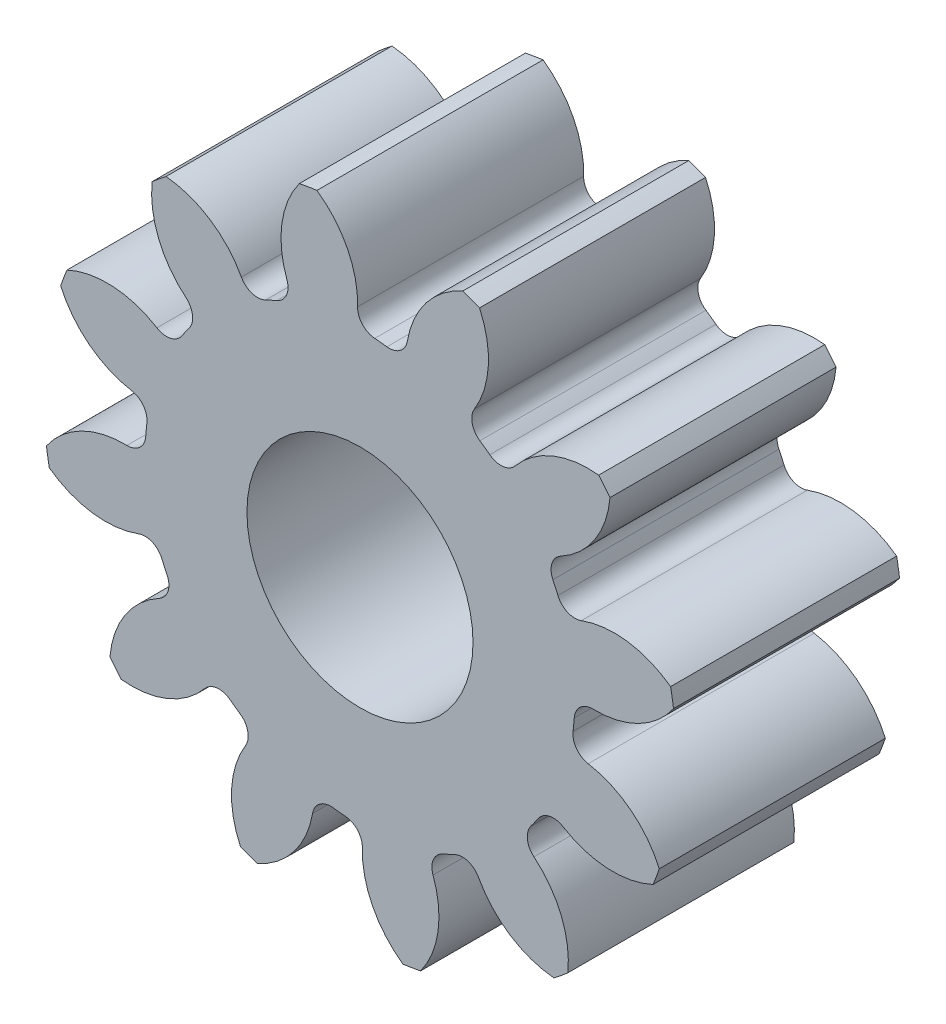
from build123d import *

# Parameters (mm, degrees)
SKETCH3_R         = 142.24
GEARBODY_DEPTH    = 101.6
TOOTHCUT_DEPTH    = 226.35970181
CIRPATTERN1_COUNT = 12
BOREDIA_R         = 50.8
BORE_DEPTH        = 12700


with BuildPart() as part:
    # Sketch3 → gearBody (new body)
    with BuildSketch(Plane.XY):
        Circle(SKETCH3_R)
    extrude(amount=GEARBODY_DEPTH)

    # Sketch2 → toothCut (cut, through all)
    with BuildSketch(Plane.XY):
        with BuildLine():
            ThreePointArc((95.757595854, -12.107569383), (96.063491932, -9.376348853), (96.291503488, -6.637526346))
            ThreePointArc((96.291503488, -6.637526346), (98.976551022, -1.08900234), (104.753389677, 1.061284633))
            ThreePointArc((104.753389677, 1.061284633), (126.198457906, 6.19643289), (142.24, 21.326853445))
            ThreePointArc((142.24, 21.326853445), (143.149673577, -13.972230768), (135.431410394, -48.429178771))
            ThreePointArc((135.431410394, -48.429178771), (122.618394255, -30.482387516), (102.571059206, -21.297342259))
            ThreePointArc((102.571059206, -21.297342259), (97.319051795, -18.070576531), (95.757595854, -12.107569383))
        make_face()
    toothcut = extrude(amount=TOOTHCUT_DEPTH, mode=Mode.SUBTRACT)

    # CirPattern1: toothCut ×12 about axis
    cirpattern1_axis = Axis((0, 0, 0), (0, 0, 1))
    for i in range(1, CIRPATTERN1_COUNT):
        add(toothcut.rotate(cirpattern1_axis, i * 360 / CIRPATTERN1_COUNT), mode=Mode.SUBTRACT)

    # boreDia → bore (cut, symmetric)
    with BuildSketch(Plane.XY):
        Circle(BOREDIA_R)
    extrude(amount=BORE_DEPTH, both=True, mode=Mode.SUBTRACT)


solid = part.part
